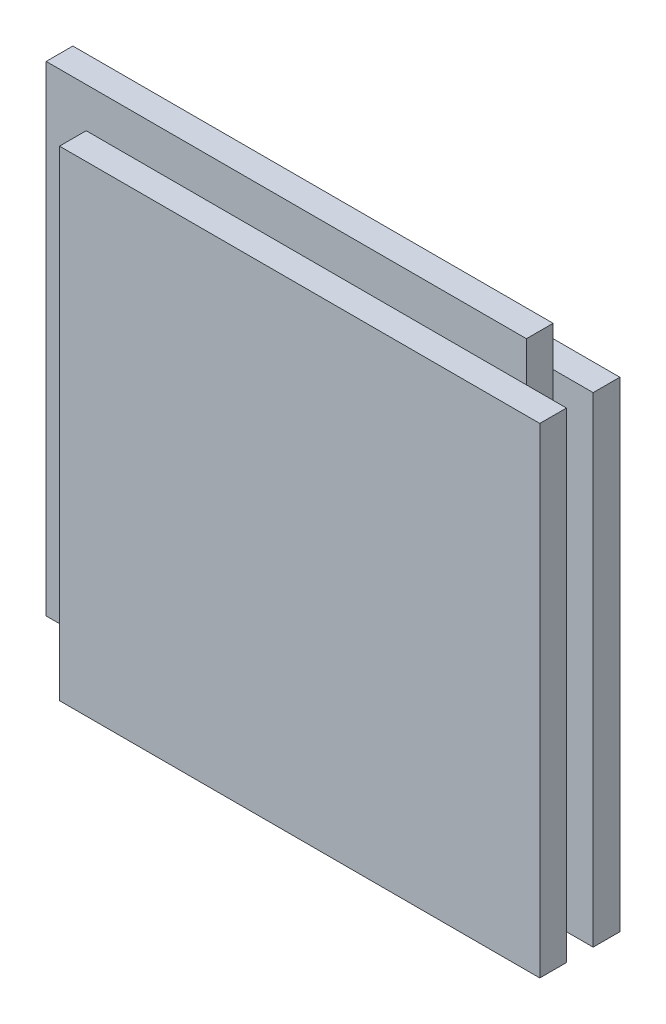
ISO-10303-21;
HEADER;
FILE_DESCRIPTION(('STEP AP214'),'2;1');
FILE_NAME('part.step','',(''),(''),'','','');
FILE_SCHEMA(('AUTOMOTIVE_DESIGN { 1 0 10303 214 1 1 1 1 }'));
ENDSEC;
DATA;
#1=APPLICATION_CONTEXT('core data for automotive mechanical design processes');
#2=APPLICATION_PROTOCOL_DEFINITION('international standard','automotive_design',2000,#1);
#3=PRODUCT_CONTEXT('',#1,'mechanical');
#4=PRODUCT('Part','Part','',(#3));
#5=PRODUCT_RELATED_PRODUCT_CATEGORY('part','',(#4));
#6=PRODUCT_DEFINITION_FORMATION('','',#4);
#7=PRODUCT_DEFINITION_CONTEXT('part definition',#1,'design');
#8=PRODUCT_DEFINITION('design','',#6,#7);
#9=PRODUCT_DEFINITION_SHAPE('','',#8);
#10=(LENGTH_UNIT() NAMED_UNIT(*) SI_UNIT(.MILLI.,.METRE.));
#11=(NAMED_UNIT(*) PLANE_ANGLE_UNIT() SI_UNIT($,.RADIAN.));
#12=(NAMED_UNIT(*) SI_UNIT($,.STERADIAN.) SOLID_ANGLE_UNIT());
#13=UNCERTAINTY_MEASURE_WITH_UNIT(LENGTH_MEASURE(1.E-05),#10,'distance_accuracy_value','');
#14=(GEOMETRIC_REPRESENTATION_CONTEXT(3) GLOBAL_UNCERTAINTY_ASSIGNED_CONTEXT((#13)) GLOBAL_UNIT_ASSIGNED_CONTEXT((#10,
#11,#12)) REPRESENTATION_CONTEXT('',''));
#15=CARTESIAN_POINT('',(0.,0.,0.));
#16=DIRECTION('',(0.,0.,1.));
#17=DIRECTION('',(1.,0.,0.));
#18=AXIS2_PLACEMENT_3D('',#15,#16,#17);
#19=CARTESIAN_POINT('',(0.,0.,-5.));
#20=DIRECTION('',(0.,0.,1.));
#21=DIRECTION('',(1.,0.,0.));
#22=AXIS2_PLACEMENT_3D('',#19,#20,#21);
#23=PLANE('',#22);
#24=DIRECTION('',(1.,0.,0.));
#25=VECTOR('',#24,1.);
#26=CARTESIAN_POINT('',(105.,75.,-5.));
#27=LINE('',#26,#25);
#28=CARTESIAN_POINT('',(-75.,75.,-5.));
#29=VERTEX_POINT('',#28);
#30=CARTESIAN_POINT('',(90.,75.,-5.));
#31=VERTEX_POINT('',#30);
#32=EDGE_CURVE('E425',#29,#31,#27,.T.);
#33=ORIENTED_EDGE('',*,*,#32,.F.);
#34=DIRECTION('',(0.,1.,0.));
#35=VECTOR('',#34,1.);
#36=CARTESIAN_POINT('',(-75.,75.,-5.));
#37=LINE('',#36,#35);
#38=CARTESIAN_POINT('',(-75.,-90.,-5.));
#39=VERTEX_POINT('',#38);
#40=EDGE_CURVE('E11',#39,#29,#37,.T.);
#41=ORIENTED_EDGE('',*,*,#40,.F.);
#42=DIRECTION('',(1.,0.,0.));
#43=VECTOR('',#42,1.);
#44=CARTESIAN_POINT('',(-90.,-90.,-5.));
#45=LINE('',#44,#43);
#46=CARTESIAN_POINT('',(-90.,-90.,-5.));
#47=VERTEX_POINT('',#46);
#48=EDGE_CURVE('E219',#47,#39,#45,.T.);
#49=ORIENTED_EDGE('',*,*,#48,.F.);
#50=DIRECTION('',(0.,-1.,0.));
#51=VECTOR('',#50,1.);
#52=CARTESIAN_POINT('',(-90.,90.,-5.));
#53=LINE('',#52,#51);
#54=CARTESIAN_POINT('',(-90.,90.,-5.));
#55=VERTEX_POINT('',#54);
#56=EDGE_CURVE('E216',#55,#47,#53,.T.);
#57=ORIENTED_EDGE('',*,*,#56,.F.);
#58=DIRECTION('',(-1.,0.,0.));
#59=VECTOR('',#58,1.);
#60=CARTESIAN_POINT('',(-90.,90.,-5.));
#61=LINE('',#60,#59);
#62=CARTESIAN_POINT('',(90.,90.,-5.));
#63=VERTEX_POINT('',#62);
#64=EDGE_CURVE('E214',#63,#55,#61,.T.);
#65=ORIENTED_EDGE('',*,*,#64,.F.);
#66=DIRECTION('',(0.,1.,0.));
#67=VECTOR('',#66,1.);
#68=CARTESIAN_POINT('',(90.,90.,-5.));
#69=LINE('',#68,#67);
#70=EDGE_CURVE('E56',#31,#63,#69,.T.);
#71=ORIENTED_EDGE('',*,*,#70,.F.);
#72=EDGE_LOOP('',(#33,#41,#49,#57,#65,#71));
#73=FACE_BOUND('',#72,.T.);
#74=ADVANCED_FACE('F34',(#73),#23,.F.);
#75=CARTESIAN_POINT('',(90.,90.,5.));
#76=DIRECTION('',(-1.,0.,0.));
#77=DIRECTION('',(0.,-1.,0.));
#78=AXIS2_PLACEMENT_3D('',#75,#76,#77);
#79=PLANE('',#78);
#80=CARTESIAN_POINT('',(90.,-90.,-5.));
#81=VERTEX_POINT('',#80);
#82=EDGE_CURVE('E212',#81,#31,#69,.T.);
#83=ORIENTED_EDGE('',*,*,#82,.T.);
#84=ORIENTED_EDGE('',*,*,#70,.T.);
#85=DIRECTION('',(0.,0.,-1.));
#86=VECTOR('',#85,1.);
#87=CARTESIAN_POINT('',(90.,90.,5.));
#88=LINE('',#87,#86);
#89=CARTESIAN_POINT('',(90.,90.,5.));
#90=VERTEX_POINT('',#89);
#91=EDGE_CURVE('E38',#90,#63,#88,.T.);
#92=ORIENTED_EDGE('',*,*,#91,.F.);
#93=DIRECTION('',(0.,1.,0.));
#94=VECTOR('',#93,1.);
#95=CARTESIAN_POINT('',(90.,90.,5.));
#96=LINE('',#95,#94);
#97=CARTESIAN_POINT('',(90.,75.,5.));
#98=VERTEX_POINT('',#97);
#99=EDGE_CURVE('E203',#98,#90,#96,.T.);
#100=ORIENTED_EDGE('',*,*,#99,.F.);
#101=CARTESIAN_POINT('',(90.,-90.,5.));
#102=VERTEX_POINT('',#101);
#103=EDGE_CURVE('E199',#102,#98,#96,.T.);
#104=ORIENTED_EDGE('',*,*,#103,.F.);
#105=DIRECTION('',(0.,0.,-1.));
#106=VECTOR('',#105,1.);
#107=CARTESIAN_POINT('',(90.,-90.,5.));
#108=LINE('',#107,#106);
#109=EDGE_CURVE('E211',#102,#81,#108,.T.);
#110=ORIENTED_EDGE('',*,*,#109,.T.);
#111=EDGE_LOOP('',(#83,#84,#92,#100,#104,#110));
#112=FACE_BOUND('',#111,.T.);
#113=ADVANCED_FACE('F36',(#112),#79,.F.);
#114=CARTESIAN_POINT('',(-90.,90.,5.));
#115=DIRECTION('',(0.,-1.,0.));
#116=DIRECTION('',(0.,0.,-1.));
#117=AXIS2_PLACEMENT_3D('',#114,#115,#116);
#118=PLANE('',#117);
#119=ORIENTED_EDGE('',*,*,#64,.T.);
#120=DIRECTION('',(0.,0.,-1.));
#121=VECTOR('',#120,1.);
#122=CARTESIAN_POINT('',(-90.,90.,5.));
#123=LINE('',#122,#121);
#124=CARTESIAN_POINT('',(-90.,90.,5.));
#125=VERTEX_POINT('',#124);
#126=EDGE_CURVE('E225',#125,#55,#123,.T.);
#127=ORIENTED_EDGE('',*,*,#126,.F.);
#128=DIRECTION('',(-1.,0.,0.));
#129=VECTOR('',#128,1.);
#130=CARTESIAN_POINT('',(-90.,90.,5.));
#131=LINE('',#130,#129);
#132=EDGE_CURVE('E202',#90,#125,#131,.T.);
#133=ORIENTED_EDGE('',*,*,#132,.F.);
#134=ORIENTED_EDGE('',*,*,#91,.T.);
#135=EDGE_LOOP('',(#119,#127,#133,#134));
#136=FACE_BOUND('',#135,.T.);
#137=ADVANCED_FACE('F263',(#136),#118,.F.);
#138=CARTESIAN_POINT('',(-90.,90.,5.));
#139=DIRECTION('',(1.,0.,0.));
#140=DIRECTION('',(0.,1.,0.));
#141=AXIS2_PLACEMENT_3D('',#138,#139,#140);
#142=PLANE('',#141);
#143=ORIENTED_EDGE('',*,*,#56,.T.);
#144=DIRECTION('',(0.,0.,-1.));
#145=VECTOR('',#144,1.);
#146=CARTESIAN_POINT('',(-90.,-90.,5.));
#147=LINE('',#146,#145);
#148=CARTESIAN_POINT('',(-90.,-90.,5.));
#149=VERTEX_POINT('',#148);
#150=EDGE_CURVE('E223',#149,#47,#147,.T.);
#151=ORIENTED_EDGE('',*,*,#150,.F.);
#152=DIRECTION('',(0.,-1.,0.));
#153=VECTOR('',#152,1.);
#154=CARTESIAN_POINT('',(-90.,90.,5.));
#155=LINE('',#154,#153);
#156=EDGE_CURVE('E205',#125,#149,#155,.T.);
#157=ORIENTED_EDGE('',*,*,#156,.F.);
#158=ORIENTED_EDGE('',*,*,#126,.T.);
#159=EDGE_LOOP('',(#143,#151,#157,#158));
#160=FACE_BOUND('',#159,.T.);
#161=ADVANCED_FACE('F265',(#160),#142,.F.);
#162=CARTESIAN_POINT('',(-90.,-90.,5.));
#163=DIRECTION('',(0.,1.,0.));
#164=DIRECTION('',(0.,0.,1.));
#165=AXIS2_PLACEMENT_3D('',#162,#163,#164);
#166=PLANE('',#165);
#167=ORIENTED_EDGE('',*,*,#48,.T.);
#168=EDGE_CURVE('E218',#39,#81,#45,.T.);
#169=ORIENTED_EDGE('',*,*,#168,.T.);
#170=ORIENTED_EDGE('',*,*,#109,.F.);
#171=DIRECTION('',(1.,0.,0.));
#172=VECTOR('',#171,1.);
#173=CARTESIAN_POINT('',(-90.,-90.,5.));
#174=LINE('',#173,#172);
#175=CARTESIAN_POINT('',(-75.,-90.,5.));
#176=VERTEX_POINT('',#175);
#177=EDGE_CURVE('E207',#176,#102,#174,.T.);
#178=ORIENTED_EDGE('',*,*,#177,.F.);
#179=EDGE_CURVE('E208',#149,#176,#174,.T.);
#180=ORIENTED_EDGE('',*,*,#179,.F.);
#181=ORIENTED_EDGE('',*,*,#150,.T.);
#182=EDGE_LOOP('',(#167,#169,#170,#178,#180,#181));
#183=FACE_BOUND('',#182,.T.);
#184=ADVANCED_FACE('F287',(#183),#166,.F.);
#185=CARTESIAN_POINT('',(0.,0.,5.));
#186=DIRECTION('',(0.,0.,1.));
#187=DIRECTION('',(1.,0.,0.));
#188=AXIS2_PLACEMENT_3D('',#185,#186,#187);
#189=PLANE('',#188);
#190=DIRECTION('',(0.,-1.,0.));
#191=VECTOR('',#190,1.);
#192=CARTESIAN_POINT('',(-75.,-105.,5.));
#193=LINE('',#192,#191);
#194=CARTESIAN_POINT('',(-75.,75.,5.));
#195=VERTEX_POINT('',#194);
#196=EDGE_CURVE('E164',#195,#176,#193,.T.);
#197=ORIENTED_EDGE('',*,*,#196,.F.);
#198=DIRECTION('',(-1.,0.,0.));
#199=VECTOR('',#198,1.);
#200=CARTESIAN_POINT('',(105.,75.,5.));
#201=LINE('',#200,#199);
#202=EDGE_CURVE('E43',#98,#195,#201,.T.);
#203=ORIENTED_EDGE('',*,*,#202,.F.);
#204=ORIENTED_EDGE('',*,*,#99,.T.);
#205=ORIENTED_EDGE('',*,*,#132,.T.);
#206=ORIENTED_EDGE('',*,*,#156,.T.);
#207=ORIENTED_EDGE('',*,*,#179,.T.);
#208=EDGE_LOOP('',(#197,#203,#204,#205,#206,#207));
#209=FACE_BOUND('',#208,.T.);
#210=ADVANCED_FACE('F262',(#209),#189,.T.);
#211=CARTESIAN_POINT('',(0.,0.,5.));
#212=DIRECTION('',(0.,0.,1.));
#213=DIRECTION('',(1.,0.,0.));
#214=AXIS2_PLACEMENT_3D('',#211,#212,#213);
#215=PLANE('',#214);
#216=ORIENTED_EDGE('',*,*,#177,.T.);
#217=ORIENTED_EDGE('',*,*,#103,.T.);
#218=CARTESIAN_POINT('',(105.,75.,5.));
#219=VERTEX_POINT('',#218);
#220=EDGE_CURVE('E174',#219,#98,#201,.T.);
#221=ORIENTED_EDGE('',*,*,#220,.F.);
#222=DIRECTION('',(0.,1.,0.));
#223=VECTOR('',#222,1.);
#224=CARTESIAN_POINT('',(105.,-105.,5.));
#225=LINE('',#224,#223);
#226=CARTESIAN_POINT('',(105.,-105.,5.));
#227=VERTEX_POINT('',#226);
#228=EDGE_CURVE('E184',#227,#219,#225,.T.);
#229=ORIENTED_EDGE('',*,*,#228,.F.);
#230=DIRECTION('',(1.,0.,0.));
#231=VECTOR('',#230,1.);
#232=CARTESIAN_POINT('',(105.,-105.,5.));
#233=LINE('',#232,#231);
#234=CARTESIAN_POINT('',(-75.,-105.,5.));
#235=VERTEX_POINT('',#234);
#236=EDGE_CURVE('E182',#235,#227,#233,.T.);
#237=ORIENTED_EDGE('',*,*,#236,.F.);
#238=EDGE_CURVE('E162',#176,#235,#193,.T.);
#239=ORIENTED_EDGE('',*,*,#238,.F.);
#240=EDGE_LOOP('',(#216,#217,#221,#229,#237,#239));
#241=FACE_BOUND('',#240,.T.);
#242=ADVANCED_FACE('F256',(#241),#215,.F.);
#243=CARTESIAN_POINT('',(-75.,-105.,15.));
#244=DIRECTION('',(1.,0.,0.));
#245=DIRECTION('',(0.,0.,-1.));
#246=AXIS2_PLACEMENT_3D('',#243,#244,#245);
#247=PLANE('',#246);
#248=ORIENTED_EDGE('',*,*,#196,.T.);
#249=ORIENTED_EDGE('',*,*,#238,.T.);
#250=DIRECTION('',(0.,0.,-1.));
#251=VECTOR('',#250,1.);
#252=CARTESIAN_POINT('',(-75.,-105.,15.));
#253=LINE('',#252,#251);
#254=CARTESIAN_POINT('',(-75.,-105.,15.));
#255=VERTEX_POINT('',#254);
#256=EDGE_CURVE('E196',#255,#235,#253,.T.);
#257=ORIENTED_EDGE('',*,*,#256,.F.);
#258=DIRECTION('',(0.,-1.,0.));
#259=VECTOR('',#258,1.);
#260=CARTESIAN_POINT('',(-75.,-105.,15.));
#261=LINE('',#260,#259);
#262=CARTESIAN_POINT('',(-75.,75.,15.));
#263=VERTEX_POINT('',#262);
#264=EDGE_CURVE('E170',#263,#255,#261,.T.);
#265=ORIENTED_EDGE('',*,*,#264,.F.);
#266=DIRECTION('',(0.,0.,-1.));
#267=VECTOR('',#266,1.);
#268=CARTESIAN_POINT('',(-75.,75.,15.));
#269=LINE('',#268,#267);
#270=EDGE_CURVE('E179',#263,#195,#269,.T.);
#271=ORIENTED_EDGE('',*,*,#270,.T.);
#272=EDGE_LOOP('',(#248,#249,#257,#265,#271));
#273=FACE_BOUND('',#272,.T.);
#274=ADVANCED_FACE('F245',(#273),#247,.F.);
#275=CARTESIAN_POINT('',(105.,-105.,15.));
#276=DIRECTION('',(0.,1.,0.));
#277=DIRECTION('',(-1.,0.,0.));
#278=AXIS2_PLACEMENT_3D('',#275,#276,#277);
#279=PLANE('',#278);
#280=ORIENTED_EDGE('',*,*,#236,.T.);
#281=DIRECTION('',(0.,0.,-1.));
#282=VECTOR('',#281,1.);
#283=CARTESIAN_POINT('',(105.,-105.,15.));
#284=LINE('',#283,#282);
#285=CARTESIAN_POINT('',(105.,-105.,15.));
#286=VERTEX_POINT('',#285);
#287=EDGE_CURVE('E193',#286,#227,#284,.T.);
#288=ORIENTED_EDGE('',*,*,#287,.F.);
#289=DIRECTION('',(1.,0.,0.));
#290=VECTOR('',#289,1.);
#291=CARTESIAN_POINT('',(105.,-105.,15.));
#292=LINE('',#291,#290);
#293=EDGE_CURVE('E173',#255,#286,#292,.T.);
#294=ORIENTED_EDGE('',*,*,#293,.F.);
#295=ORIENTED_EDGE('',*,*,#256,.T.);
#296=EDGE_LOOP('',(#280,#288,#294,#295));
#297=FACE_BOUND('',#296,.T.);
#298=ADVANCED_FACE('F269',(#297),#279,.F.);
#299=CARTESIAN_POINT('',(105.,-105.,15.));
#300=DIRECTION('',(-1.,0.,0.));
#301=DIRECTION('',(0.,0.,1.));
#302=AXIS2_PLACEMENT_3D('',#299,#300,#301);
#303=PLANE('',#302);
#304=ORIENTED_EDGE('',*,*,#228,.T.);
#305=DIRECTION('',(0.,0.,-1.));
#306=VECTOR('',#305,1.);
#307=CARTESIAN_POINT('',(105.,75.,15.));
#308=LINE('',#307,#306);
#309=CARTESIAN_POINT('',(105.,75.,15.));
#310=VERTEX_POINT('',#309);
#311=EDGE_CURVE('E190',#310,#219,#308,.T.);
#312=ORIENTED_EDGE('',*,*,#311,.F.);
#313=DIRECTION('',(0.,1.,0.));
#314=VECTOR('',#313,1.);
#315=CARTESIAN_POINT('',(105.,-105.,15.));
#316=LINE('',#315,#314);
#317=EDGE_CURVE('E176',#286,#310,#316,.T.);
#318=ORIENTED_EDGE('',*,*,#317,.F.);
#319=ORIENTED_EDGE('',*,*,#287,.T.);
#320=EDGE_LOOP('',(#304,#312,#318,#319));
#321=FACE_BOUND('',#320,.T.);
#322=ADVANCED_FACE('F270',(#321),#303,.F.);
#323=CARTESIAN_POINT('',(105.,75.,15.));
#324=DIRECTION('',(0.,-1.,0.));
#325=DIRECTION('',(1.,0.,0.));
#326=AXIS2_PLACEMENT_3D('',#323,#324,#325);
#327=PLANE('',#326);
#328=ORIENTED_EDGE('',*,*,#220,.T.);
#329=ORIENTED_EDGE('',*,*,#202,.T.);
#330=ORIENTED_EDGE('',*,*,#270,.F.);
#331=DIRECTION('',(-1.,0.,0.));
#332=VECTOR('',#331,1.);
#333=CARTESIAN_POINT('',(105.,75.,15.));
#334=LINE('',#333,#332);
#335=EDGE_CURVE('E178',#310,#263,#334,.T.);
#336=ORIENTED_EDGE('',*,*,#335,.F.);
#337=ORIENTED_EDGE('',*,*,#311,.T.);
#338=EDGE_LOOP('',(#328,#329,#330,#336,#337));
#339=FACE_BOUND('',#338,.T.);
#340=ADVANCED_FACE('F238',(#339),#327,.F.);
#341=CARTESIAN_POINT('',(0.,0.,15.));
#342=DIRECTION('',(0.,0.,1.));
#343=DIRECTION('',(1.,0.,0.));
#344=AXIS2_PLACEMENT_3D('',#341,#342,#343);
#345=PLANE('',#344);
#346=ORIENTED_EDGE('',*,*,#264,.T.);
#347=ORIENTED_EDGE('',*,*,#293,.T.);
#348=ORIENTED_EDGE('',*,*,#317,.T.);
#349=ORIENTED_EDGE('',*,*,#335,.T.);
#350=EDGE_LOOP('',(#346,#347,#348,#349));
#351=FACE_BOUND('',#350,.T.);
#352=ADVANCED_FACE('F248',(#351),#345,.T.);
#353=CARTESIAN_POINT('',(0.,0.,-5.));
#354=DIRECTION('',(0.,0.,1.));
#355=DIRECTION('',(1.,0.,0.));
#356=AXIS2_PLACEMENT_3D('',#353,#354,#355);
#357=PLANE('',#356);
#358=ORIENTED_EDGE('',*,*,#82,.F.);
#359=ORIENTED_EDGE('',*,*,#168,.F.);
#360=CARTESIAN_POINT('',(-75.,-105.,-5.));
#361=VERTEX_POINT('',#360);
#362=EDGE_CURVE('E45',#361,#39,#37,.T.);
#363=ORIENTED_EDGE('',*,*,#362,.F.);
#364=DIRECTION('',(-1.,0.,0.));
#365=VECTOR('',#364,1.);
#366=CARTESIAN_POINT('',(-75.,-105.,-5.));
#367=LINE('',#366,#365);
#368=CARTESIAN_POINT('',(105.,-105.,-5.));
#369=VERTEX_POINT('',#368);
#370=EDGE_CURVE('E161',#369,#361,#367,.T.);
#371=ORIENTED_EDGE('',*,*,#370,.F.);
#372=DIRECTION('',(0.,-1.,0.));
#373=VECTOR('',#372,1.);
#374=CARTESIAN_POINT('',(105.,-105.,-5.));
#375=LINE('',#374,#373);
#376=CARTESIAN_POINT('',(105.,75.,-5.));
#377=VERTEX_POINT('',#376);
#378=EDGE_CURVE('E157',#377,#369,#375,.T.);
#379=ORIENTED_EDGE('',*,*,#378,.F.);
#380=EDGE_CURVE('E430',#31,#377,#27,.T.);
#381=ORIENTED_EDGE('',*,*,#380,.F.);
#382=EDGE_LOOP('',(#358,#359,#363,#371,#379,#381));
#383=FACE_BOUND('',#382,.T.);
#384=ADVANCED_FACE('F343',(#383),#357,.T.);
#385=CARTESIAN_POINT('',(-75.,-105.,-15.));
#386=DIRECTION('',(0.,1.,0.));
#387=DIRECTION('',(-1.,0.,0.));
#388=AXIS2_PLACEMENT_3D('',#385,#386,#387);
#389=PLANE('',#388);
#390=ORIENTED_EDGE('',*,*,#370,.T.);
#391=DIRECTION('',(0.,0.,1.));
#392=VECTOR('',#391,1.);
#393=CARTESIAN_POINT('',(-75.,-105.,-15.));
#394=LINE('',#393,#392);
#395=CARTESIAN_POINT('',(-75.,-105.,-15.));
#396=VERTEX_POINT('',#395);
#397=EDGE_CURVE('E141',#396,#361,#394,.T.);
#398=ORIENTED_EDGE('',*,*,#397,.F.);
#399=DIRECTION('',(-1.,0.,0.));
#400=VECTOR('',#399,1.);
#401=CARTESIAN_POINT('',(-75.,-105.,-15.));
#402=LINE('',#401,#400);
#403=CARTESIAN_POINT('',(105.,-105.,-15.));
#404=VERTEX_POINT('',#403);
#405=EDGE_CURVE('E148',#404,#396,#402,.T.);
#406=ORIENTED_EDGE('',*,*,#405,.F.);
#407=DIRECTION('',(0.,0.,1.));
#408=VECTOR('',#407,1.);
#409=CARTESIAN_POINT('',(105.,-105.,-15.));
#410=LINE('',#409,#408);
#411=EDGE_CURVE('E422',#404,#369,#410,.T.);
#412=ORIENTED_EDGE('',*,*,#411,.T.);
#413=EDGE_LOOP('',(#390,#398,#406,#412));
#414=FACE_BOUND('',#413,.T.);
#415=ADVANCED_FACE('F159',(#414),#389,.F.);
#416=CARTESIAN_POINT('',(-75.,75.,-15.));
#417=DIRECTION('',(1.,0.,0.));
#418=DIRECTION('',(0.,0.,-1.));
#419=AXIS2_PLACEMENT_3D('',#416,#417,#418);
#420=PLANE('',#419);
#421=ORIENTED_EDGE('',*,*,#362,.T.);
#422=ORIENTED_EDGE('',*,*,#40,.T.);
#423=DIRECTION('',(0.,0.,1.));
#424=VECTOR('',#423,1.);
#425=CARTESIAN_POINT('',(-75.,75.,-15.));
#426=LINE('',#425,#424);
#427=CARTESIAN_POINT('',(-75.,75.,-15.));
#428=VERTEX_POINT('',#427);
#429=EDGE_CURVE('E144',#428,#29,#426,.T.);
#430=ORIENTED_EDGE('',*,*,#429,.F.);
#431=DIRECTION('',(0.,1.,0.));
#432=VECTOR('',#431,1.);
#433=CARTESIAN_POINT('',(-75.,75.,-15.));
#434=LINE('',#433,#432);
#435=EDGE_CURVE('E136',#396,#428,#434,.T.);
#436=ORIENTED_EDGE('',*,*,#435,.F.);
#437=ORIENTED_EDGE('',*,*,#397,.T.);
#438=EDGE_LOOP('',(#421,#422,#430,#436,#437));
#439=FACE_BOUND('',#438,.T.);
#440=ADVANCED_FACE('F139',(#439),#420,.F.);
#441=CARTESIAN_POINT('',(105.,75.,-15.));
#442=DIRECTION('',(0.,-1.,0.));
#443=DIRECTION('',(1.,0.,0.));
#444=AXIS2_PLACEMENT_3D('',#441,#442,#443);
#445=PLANE('',#444);
#446=ORIENTED_EDGE('',*,*,#32,.T.);
#447=ORIENTED_EDGE('',*,*,#380,.T.);
#448=DIRECTION('',(0.,0.,1.));
#449=VECTOR('',#448,1.);
#450=CARTESIAN_POINT('',(105.,75.,-15.));
#451=LINE('',#450,#449);
#452=CARTESIAN_POINT('',(105.,75.,-15.));
#453=VERTEX_POINT('',#452);
#454=EDGE_CURVE('E166',#453,#377,#451,.T.);
#455=ORIENTED_EDGE('',*,*,#454,.F.);
#456=DIRECTION('',(1.,0.,0.));
#457=VECTOR('',#456,1.);
#458=CARTESIAN_POINT('',(105.,75.,-15.));
#459=LINE('',#458,#457);
#460=EDGE_CURVE('E147',#428,#453,#459,.T.);
#461=ORIENTED_EDGE('',*,*,#460,.F.);
#462=ORIENTED_EDGE('',*,*,#429,.T.);
#463=EDGE_LOOP('',(#446,#447,#455,#461,#462));
#464=FACE_BOUND('',#463,.T.);
#465=ADVANCED_FACE('F388',(#464),#445,.F.);
#466=CARTESIAN_POINT('',(105.,-105.,-15.));
#467=DIRECTION('',(-1.,0.,0.));
#468=DIRECTION('',(0.,0.,1.));
#469=AXIS2_PLACEMENT_3D('',#466,#467,#468);
#470=PLANE('',#469);
#471=ORIENTED_EDGE('',*,*,#378,.T.);
#472=ORIENTED_EDGE('',*,*,#411,.F.);
#473=DIRECTION('',(0.,-1.,0.));
#474=VECTOR('',#473,1.);
#475=CARTESIAN_POINT('',(105.,-105.,-15.));
#476=LINE('',#475,#474);
#477=EDGE_CURVE('E153',#453,#404,#476,.T.);
#478=ORIENTED_EDGE('',*,*,#477,.F.);
#479=ORIENTED_EDGE('',*,*,#454,.T.);
#480=EDGE_LOOP('',(#471,#472,#478,#479));
#481=FACE_BOUND('',#480,.T.);
#482=ADVANCED_FACE('F396',(#481),#470,.F.);
#483=CARTESIAN_POINT('',(0.,0.,-15.));
#484=DIRECTION('',(0.,0.,1.));
#485=DIRECTION('',(1.,0.,0.));
#486=AXIS2_PLACEMENT_3D('',#483,#484,#485);
#487=PLANE('',#486);
#488=ORIENTED_EDGE('',*,*,#405,.T.);
#489=ORIENTED_EDGE('',*,*,#435,.T.);
#490=ORIENTED_EDGE('',*,*,#460,.T.);
#491=ORIENTED_EDGE('',*,*,#477,.T.);
#492=EDGE_LOOP('',(#488,#489,#490,#491));
#493=FACE_BOUND('',#492,.T.);
#494=ADVANCED_FACE('F151',(#493),#487,.F.);
#495=CLOSED_SHELL('',(#74,#113,#137,#161,#184,#210,#242,#274,#298,#322,#340,#352,#384,#415,#440,
#465,#482,#494));
#496=MANIFOLD_SOLID_BREP('B2',#495);
#497=ADVANCED_BREP_SHAPE_REPRESENTATION('',(#18,#496),#14);
#498=SHAPE_DEFINITION_REPRESENTATION(#9,#497);
ENDSEC;
END-ISO-10303-21;
